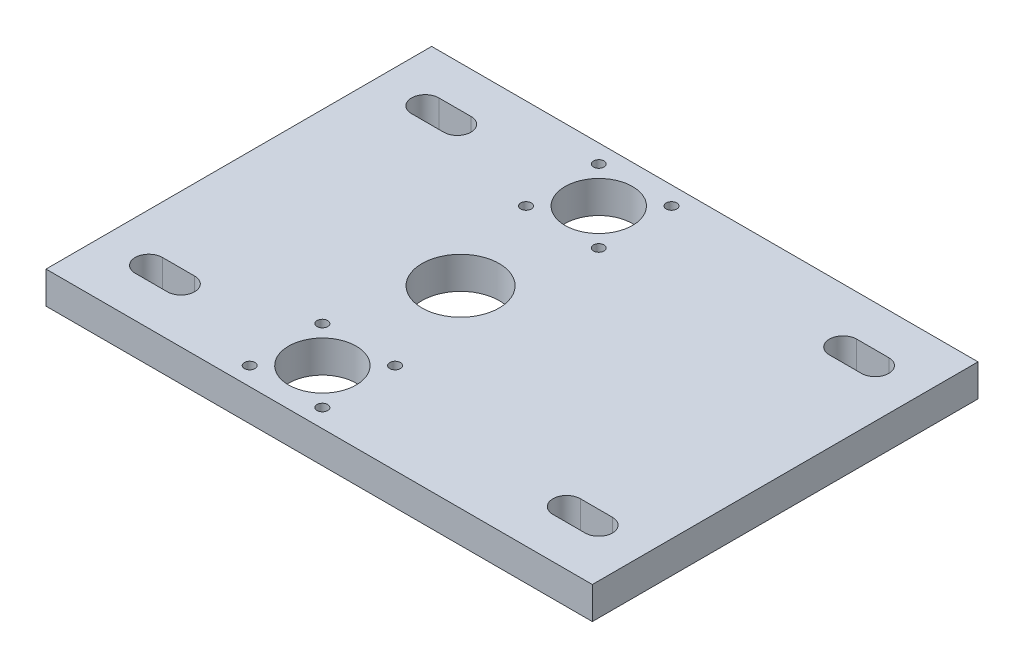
ISO-10303-21;
HEADER;
FILE_DESCRIPTION(('STEP AP214'),'2;1');
FILE_NAME('part.step','',(''),(''),'','','');
FILE_SCHEMA(('AUTOMOTIVE_DESIGN { 1 0 10303 214 1 1 1 1 }'));
ENDSEC;
DATA;
#1=APPLICATION_CONTEXT('core data for automotive mechanical design processes');
#2=APPLICATION_PROTOCOL_DEFINITION('international standard','automotive_design',2000,#1);
#3=PRODUCT_CONTEXT('',#1,'mechanical');
#4=PRODUCT('Part','Part','',(#3));
#5=PRODUCT_RELATED_PRODUCT_CATEGORY('part','',(#4));
#6=PRODUCT_DEFINITION_FORMATION('','',#4);
#7=PRODUCT_DEFINITION_CONTEXT('part definition',#1,'design');
#8=PRODUCT_DEFINITION('design','',#6,#7);
#9=PRODUCT_DEFINITION_SHAPE('','',#8);
#10=(LENGTH_UNIT() NAMED_UNIT(*) SI_UNIT(.MILLI.,.METRE.));
#11=(NAMED_UNIT(*) PLANE_ANGLE_UNIT() SI_UNIT($,.RADIAN.));
#12=(NAMED_UNIT(*) SI_UNIT($,.STERADIAN.) SOLID_ANGLE_UNIT());
#13=UNCERTAINTY_MEASURE_WITH_UNIT(LENGTH_MEASURE(1.E-05),#10,'distance_accuracy_value','');
#14=(GEOMETRIC_REPRESENTATION_CONTEXT(3) GLOBAL_UNCERTAINTY_ASSIGNED_CONTEXT((#13)) GLOBAL_UNIT_ASSIGNED_CONTEXT((#10,
#11,#12)) REPRESENTATION_CONTEXT('',''));
#15=CARTESIAN_POINT('',(0.,0.,0.));
#16=DIRECTION('',(0.,0.,1.));
#17=DIRECTION('',(1.,0.,0.));
#18=AXIS2_PLACEMENT_3D('',#15,#16,#17);
#19=CARTESIAN_POINT('',(0.,10.,0.));
#20=DIRECTION('',(0.,1.,0.));
#21=DIRECTION('',(0.,0.,1.));
#22=AXIS2_PLACEMENT_3D('',#19,#20,#21);
#23=PLANE('',#22);
#24=DIRECTION('',(0.,0.,-1.));
#25=VECTOR('',#24,1.);
#26=CARTESIAN_POINT('',(-85.,10.,-60.));
#27=LINE('',#26,#25);
#28=CARTESIAN_POINT('',(-85.,10.,-60.));
#29=VERTEX_POINT('',#28);
#30=CARTESIAN_POINT('',(-85.,10.,60.));
#31=VERTEX_POINT('',#30);
#32=EDGE_CURVE('E739',#29,#31,#27,.F.);
#33=ORIENTED_EDGE('',*,*,#32,.T.);
#34=DIRECTION('',(-1.,0.,0.));
#35=VECTOR('',#34,1.);
#36=CARTESIAN_POINT('',(-85.,10.,60.));
#37=LINE('',#36,#35);
#38=CARTESIAN_POINT('',(85.,10.,60.));
#39=VERTEX_POINT('',#38);
#40=EDGE_CURVE('E734',#31,#39,#37,.F.);
#41=ORIENTED_EDGE('',*,*,#40,.T.);
#42=DIRECTION('',(0.,0.,1.));
#43=VECTOR('',#42,1.);
#44=CARTESIAN_POINT('',(85.,10.,-60.));
#45=LINE('',#44,#43);
#46=CARTESIAN_POINT('',(85.,10.,-60.));
#47=VERTEX_POINT('',#46);
#48=EDGE_CURVE('E730',#39,#47,#45,.F.);
#49=ORIENTED_EDGE('',*,*,#48,.T.);
#50=DIRECTION('',(1.,0.,0.));
#51=VECTOR('',#50,1.);
#52=CARTESIAN_POINT('',(-85.,10.,-60.));
#53=LINE('',#52,#51);
#54=EDGE_CURVE('E256',#47,#29,#53,.F.);
#55=ORIENTED_EDGE('',*,*,#54,.T.);
#56=EDGE_LOOP('',(#33,#41,#49,#55));
#57=FACE_BOUND('',#56,.T.);
#58=CARTESIAN_POINT('',(-16.,10.,-43.));
#59=DIRECTION('',(0.,1.,0.));
#60=DIRECTION('',(0.,0.,1.));
#61=AXIS2_PLACEMENT_3D('',#58,#59,#60);
#62=CIRCLE('',#61,10.5);
#63=CARTESIAN_POINT('',(-16.,10.,-32.5));
#64=VERTEX_POINT('',#63);
#65=EDGE_CURVE('E253',#64,#64,#62,.F.);
#66=ORIENTED_EDGE('',*,*,#65,.T.);
#67=EDGE_LOOP('',(#66));
#68=FACE_BOUND('',#67,.T.);
#69=CARTESIAN_POINT('',(-16.,10.,0.));
#70=DIRECTION('',(0.,1.,0.));
#71=DIRECTION('',(0.,0.,1.));
#72=AXIS2_PLACEMENT_3D('',#69,#70,#71);
#73=CIRCLE('',#72,12.);
#74=CARTESIAN_POINT('',(-16.,10.,12.));
#75=VERTEX_POINT('',#74);
#76=EDGE_CURVE('E257',#75,#75,#73,.F.);
#77=ORIENTED_EDGE('',*,*,#76,.T.);
#78=EDGE_LOOP('',(#77));
#79=FACE_BOUND('',#78,.T.);
#80=CARTESIAN_POINT('',(-16.,10.,43.));
#81=DIRECTION('',(0.,1.,0.));
#82=DIRECTION('',(0.,0.,1.));
#83=AXIS2_PLACEMENT_3D('',#80,#81,#82);
#84=CIRCLE('',#83,10.5);
#85=CARTESIAN_POINT('',(-16.,10.,53.5));
#86=VERTEX_POINT('',#85);
#87=EDGE_CURVE('E260',#86,#86,#84,.F.);
#88=ORIENTED_EDGE('',*,*,#87,.T.);
#89=EDGE_LOOP('',(#88));
#90=FACE_BOUND('',#89,.T.);
#91=CARTESIAN_POINT('',(-60.,10.,43.));
#92=DIRECTION('',(0.,1.,0.));
#93=DIRECTION('',(0.,0.,1.));
#94=AXIS2_PLACEMENT_3D('',#91,#92,#93);
#95=CIRCLE('',#94,4.24999999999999);
#96=CARTESIAN_POINT('',(-60.,10.,38.75));
#97=VERTEX_POINT('',#96);
#98=CARTESIAN_POINT('',(-60.,10.,47.25));
#99=VERTEX_POINT('',#98);
#100=EDGE_CURVE('E268',#97,#99,#95,.F.);
#101=ORIENTED_EDGE('',*,*,#100,.T.);
#102=DIRECTION('',(1.,0.,0.));
#103=VECTOR('',#102,1.);
#104=CARTESIAN_POINT('',(-70.,10.,47.25));
#105=LINE('',#104,#103);
#106=CARTESIAN_POINT('',(-70.,10.,47.25));
#107=VERTEX_POINT('',#106);
#108=EDGE_CURVE('E752',#99,#107,#105,.F.);
#109=ORIENTED_EDGE('',*,*,#108,.T.);
#110=CARTESIAN_POINT('',(-70.,10.,43.));
#111=DIRECTION('',(0.,1.,0.));
#112=DIRECTION('',(0.,0.,1.));
#113=AXIS2_PLACEMENT_3D('',#110,#111,#112);
#114=CIRCLE('',#113,4.25);
#115=CARTESIAN_POINT('',(-70.,10.,38.75));
#116=VERTEX_POINT('',#115);
#117=EDGE_CURVE('E264',#107,#116,#114,.F.);
#118=ORIENTED_EDGE('',*,*,#117,.T.);
#119=DIRECTION('',(-1.,0.,0.));
#120=VECTOR('',#119,1.);
#121=CARTESIAN_POINT('',(-70.,10.,38.75));
#122=LINE('',#121,#120);
#123=EDGE_CURVE('E263',#116,#97,#122,.F.);
#124=ORIENTED_EDGE('',*,*,#123,.T.);
#125=EDGE_LOOP('',(#101,#109,#118,#124));
#126=FACE_BOUND('',#125,.T.);
#127=CARTESIAN_POINT('',(60.0000000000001,10.,43.));
#128=DIRECTION('',(0.,1.,0.));
#129=DIRECTION('',(0.,0.,1.));
#130=AXIS2_PLACEMENT_3D('',#127,#128,#129);
#131=CIRCLE('',#130,4.25);
#132=CARTESIAN_POINT('',(60.0000000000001,10.,47.25));
#133=VERTEX_POINT('',#132);
#134=CARTESIAN_POINT('',(60.0000000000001,10.,38.75));
#135=VERTEX_POINT('',#134);
#136=EDGE_CURVE('E276',#133,#135,#131,.F.);
#137=ORIENTED_EDGE('',*,*,#136,.T.);
#138=DIRECTION('',(-1.,0.,0.));
#139=VECTOR('',#138,1.);
#140=CARTESIAN_POINT('',(70.,10.,38.75));
#141=LINE('',#140,#139);
#142=CARTESIAN_POINT('',(70.,10.,38.75));
#143=VERTEX_POINT('',#142);
#144=EDGE_CURVE('E762',#135,#143,#141,.F.);
#145=ORIENTED_EDGE('',*,*,#144,.T.);
#146=CARTESIAN_POINT('',(70.,10.,43.));
#147=DIRECTION('',(0.,1.,0.));
#148=DIRECTION('',(0.,0.,1.));
#149=AXIS2_PLACEMENT_3D('',#146,#147,#148);
#150=CIRCLE('',#149,4.25);
#151=CARTESIAN_POINT('',(70.,10.,47.25));
#152=VERTEX_POINT('',#151);
#153=EDGE_CURVE('E272',#143,#152,#150,.F.);
#154=ORIENTED_EDGE('',*,*,#153,.T.);
#155=DIRECTION('',(1.,0.,0.));
#156=VECTOR('',#155,1.);
#157=CARTESIAN_POINT('',(70.,10.,47.25));
#158=LINE('',#157,#156);
#159=EDGE_CURVE('E271',#152,#133,#158,.F.);
#160=ORIENTED_EDGE('',*,*,#159,.T.);
#161=EDGE_LOOP('',(#137,#145,#154,#160));
#162=FACE_BOUND('',#161,.T.);
#163=CARTESIAN_POINT('',(-60.,10.,-43.));
#164=DIRECTION('',(0.,1.,0.));
#165=DIRECTION('',(0.,0.,1.));
#166=AXIS2_PLACEMENT_3D('',#163,#164,#165);
#167=CIRCLE('',#166,4.24999999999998);
#168=CARTESIAN_POINT('',(-60.,10.,-47.25));
#169=VERTEX_POINT('',#168);
#170=CARTESIAN_POINT('',(-60.,10.,-38.75));
#171=VERTEX_POINT('',#170);
#172=EDGE_CURVE('E176',#169,#171,#167,.F.);
#173=ORIENTED_EDGE('',*,*,#172,.T.);
#174=DIRECTION('',(1.,0.,0.));
#175=VECTOR('',#174,1.);
#176=CARTESIAN_POINT('',(-70.,10.,-38.75));
#177=LINE('',#176,#175);
#178=CARTESIAN_POINT('',(-70.,10.,-38.75));
#179=VERTEX_POINT('',#178);
#180=EDGE_CURVE('E183',#171,#179,#177,.F.);
#181=ORIENTED_EDGE('',*,*,#180,.T.);
#182=CARTESIAN_POINT('',(-70.,10.,-43.));
#183=DIRECTION('',(0.,1.,0.));
#184=DIRECTION('',(0.,0.,1.));
#185=AXIS2_PLACEMENT_3D('',#182,#183,#184);
#186=CIRCLE('',#185,4.25);
#187=CARTESIAN_POINT('',(-70.,10.,-47.25));
#188=VERTEX_POINT('',#187);
#189=EDGE_CURVE('E280',#179,#188,#186,.F.);
#190=ORIENTED_EDGE('',*,*,#189,.T.);
#191=DIRECTION('',(-1.,0.,0.));
#192=VECTOR('',#191,1.);
#193=CARTESIAN_POINT('',(-70.,10.,-47.25));
#194=LINE('',#193,#192);
#195=EDGE_CURVE('E279',#188,#169,#194,.F.);
#196=ORIENTED_EDGE('',*,*,#195,.T.);
#197=EDGE_LOOP('',(#173,#181,#190,#196));
#198=FACE_BOUND('',#197,.T.);
#199=CARTESIAN_POINT('',(70.,10.,-43.));
#200=DIRECTION('',(0.,1.,0.));
#201=DIRECTION('',(0.,0.,1.));
#202=AXIS2_PLACEMENT_3D('',#199,#200,#201);
#203=CIRCLE('',#202,4.25);
#204=CARTESIAN_POINT('',(70.,10.,-47.25));
#205=VERTEX_POINT('',#204);
#206=CARTESIAN_POINT('',(70.,10.,-38.75));
#207=VERTEX_POINT('',#206);
#208=EDGE_CURVE('E152',#205,#207,#203,.F.);
#209=ORIENTED_EDGE('',*,*,#208,.T.);
#210=DIRECTION('',(1.,0.,0.));
#211=VECTOR('',#210,1.);
#212=CARTESIAN_POINT('',(60.0000000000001,10.,-38.75));
#213=LINE('',#212,#211);
#214=CARTESIAN_POINT('',(60.0000000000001,10.,-38.75));
#215=VERTEX_POINT('',#214);
#216=EDGE_CURVE('E185',#207,#215,#213,.F.);
#217=ORIENTED_EDGE('',*,*,#216,.T.);
#218=CARTESIAN_POINT('',(60.0000000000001,10.,-43.));
#219=DIRECTION('',(0.,1.,0.));
#220=DIRECTION('',(0.,0.,1.));
#221=AXIS2_PLACEMENT_3D('',#218,#219,#220);
#222=CIRCLE('',#221,4.25);
#223=CARTESIAN_POINT('',(60.0000000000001,10.,-47.25));
#224=VERTEX_POINT('',#223);
#225=EDGE_CURVE('E172',#215,#224,#222,.F.);
#226=ORIENTED_EDGE('',*,*,#225,.T.);
#227=DIRECTION('',(-1.,0.,0.));
#228=VECTOR('',#227,1.);
#229=CARTESIAN_POINT('',(60.0000000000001,10.,-47.25));
#230=LINE('',#229,#228);
#231=EDGE_CURVE('E167',#224,#205,#230,.F.);
#232=ORIENTED_EDGE('',*,*,#231,.T.);
#233=EDGE_LOOP('',(#209,#217,#226,#232));
#234=FACE_BOUND('',#233,.T.);
#235=CARTESIAN_POINT('',(-27.3137084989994,10.,54.3137084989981));
#236=DIRECTION('',(0.,1.,0.));
#237=DIRECTION('',(0.,0.,1.));
#238=AXIS2_PLACEMENT_3D('',#235,#236,#237);
#239=CIRCLE('',#238,1.64999999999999);
#240=CARTESIAN_POINT('',(-27.3137084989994,10.,55.9637084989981));
#241=VERTEX_POINT('',#240);
#242=EDGE_CURVE('E162',#241,#241,#239,.F.);
#243=ORIENTED_EDGE('',*,*,#242,.T.);
#244=EDGE_LOOP('',(#243));
#245=FACE_BOUND('',#244,.T.);
#246=CARTESIAN_POINT('',(-4.68629150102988,10.,54.3137084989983));
#247=DIRECTION('',(0.,1.,0.));
#248=DIRECTION('',(0.,0.,1.));
#249=AXIS2_PLACEMENT_3D('',#246,#247,#248);
#250=CIRCLE('',#249,1.64999999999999);
#251=CARTESIAN_POINT('',(-4.68629150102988,10.,55.9637084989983));
#252=VERTEX_POINT('',#251);
#253=EDGE_CURVE('E287',#252,#252,#250,.F.);
#254=ORIENTED_EDGE('',*,*,#253,.T.);
#255=EDGE_LOOP('',(#254));
#256=FACE_BOUND('',#255,.T.);
#257=CARTESIAN_POINT('',(-4.68629150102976,10.,31.6862915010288));
#258=DIRECTION('',(0.,1.,0.));
#259=DIRECTION('',(0.,0.,1.));
#260=AXIS2_PLACEMENT_3D('',#257,#258,#259);
#261=CIRCLE('',#260,1.64999999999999);
#262=CARTESIAN_POINT('',(-4.68629150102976,10.,33.3362915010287));
#263=VERTEX_POINT('',#262);
#264=EDGE_CURVE('E290',#263,#263,#261,.F.);
#265=ORIENTED_EDGE('',*,*,#264,.T.);
#266=EDGE_LOOP('',(#265));
#267=FACE_BOUND('',#266,.T.);
#268=CARTESIAN_POINT('',(-27.3137084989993,10.,31.6862915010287));
#269=DIRECTION('',(0.,1.,0.));
#270=DIRECTION('',(0.,0.,1.));
#271=AXIS2_PLACEMENT_3D('',#268,#269,#270);
#272=CIRCLE('',#271,1.64999999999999);
#273=CARTESIAN_POINT('',(-27.3137084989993,10.,33.3362915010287));
#274=VERTEX_POINT('',#273);
#275=EDGE_CURVE('E293',#274,#274,#272,.F.);
#276=ORIENTED_EDGE('',*,*,#275,.T.);
#277=EDGE_LOOP('',(#276));
#278=FACE_BOUND('',#277,.T.);
#279=CARTESIAN_POINT('',(-27.3137084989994,10.,-31.6862915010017));
#280=DIRECTION('',(0.,1.,0.));
#281=DIRECTION('',(0.,0.,1.));
#282=AXIS2_PLACEMENT_3D('',#279,#280,#281);
#283=CIRCLE('',#282,1.64999999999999);
#284=CARTESIAN_POINT('',(-27.3137084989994,10.,-30.0362915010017));
#285=VERTEX_POINT('',#284);
#286=EDGE_CURVE('E296',#285,#285,#283,.F.);
#287=ORIENTED_EDGE('',*,*,#286,.T.);
#288=EDGE_LOOP('',(#287));
#289=FACE_BOUND('',#288,.T.);
#290=CARTESIAN_POINT('',(-4.68629150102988,10.,-31.6862915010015));
#291=DIRECTION('',(0.,1.,0.));
#292=DIRECTION('',(0.,0.,1.));
#293=AXIS2_PLACEMENT_3D('',#290,#291,#292);
#294=CIRCLE('',#293,1.64999999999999);
#295=CARTESIAN_POINT('',(-4.68629150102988,10.,-30.0362915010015));
#296=VERTEX_POINT('',#295);
#297=EDGE_CURVE('E299',#296,#296,#294,.F.);
#298=ORIENTED_EDGE('',*,*,#297,.T.);
#299=EDGE_LOOP('',(#298));
#300=FACE_BOUND('',#299,.T.);
#301=CARTESIAN_POINT('',(-4.68629150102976,10.,-54.3137084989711));
#302=DIRECTION('',(0.,1.,0.));
#303=DIRECTION('',(0.,0.,1.));
#304=AXIS2_PLACEMENT_3D('',#301,#302,#303);
#305=CIRCLE('',#304,1.64999999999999);
#306=CARTESIAN_POINT('',(-4.68629150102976,10.,-52.6637084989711));
#307=VERTEX_POINT('',#306);
#308=EDGE_CURVE('E301',#307,#307,#305,.F.);
#309=ORIENTED_EDGE('',*,*,#308,.T.);
#310=EDGE_LOOP('',(#309));
#311=FACE_BOUND('',#310,.T.);
#312=CARTESIAN_POINT('',(-27.3137084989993,10.,-54.3137084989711));
#313=DIRECTION('',(0.,1.,0.));
#314=DIRECTION('',(0.,0.,1.));
#315=AXIS2_PLACEMENT_3D('',#312,#313,#314);
#316=CIRCLE('',#315,1.64999999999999);
#317=CARTESIAN_POINT('',(-27.3137084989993,10.,-52.6637084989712));
#318=VERTEX_POINT('',#317);
#319=EDGE_CURVE('E20',#318,#318,#316,.F.);
#320=ORIENTED_EDGE('',*,*,#319,.T.);
#321=EDGE_LOOP('',(#320));
#322=FACE_BOUND('',#321,.T.);
#323=ADVANCED_FACE('F17',(#57,#68,#79,#90,#126,#162,#198,#234,#245,#256,#267,#278,#289,#300,
#311,#322),#23,.T.);
#324=CARTESIAN_POINT('',(-27.3137084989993,10.,-54.3137084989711));
#325=DIRECTION('',(0.,1.,0.));
#326=DIRECTION('',(0.,0.,1.));
#327=AXIS2_PLACEMENT_3D('',#324,#325,#326);
#328=CYLINDRICAL_SURFACE('',#327,1.64999999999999);
#329=CARTESIAN_POINT('',(-27.3137084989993,0.,-54.3137084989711));
#330=DIRECTION('',(0.,1.,0.));
#331=DIRECTION('',(0.,0.,1.));
#332=AXIS2_PLACEMENT_3D('',#329,#330,#331);
#333=CIRCLE('',#332,1.64999999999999);
#334=CARTESIAN_POINT('',(-27.3137084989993,0.,-52.6637084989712));
#335=VERTEX_POINT('',#334);
#336=EDGE_CURVE('E249',#335,#335,#333,.F.);
#337=ORIENTED_EDGE('',*,*,#336,.T.);
#338=EDGE_LOOP('',(#337));
#339=FACE_BOUND('',#338,.T.);
#340=ORIENTED_EDGE('',*,*,#319,.F.);
#341=EDGE_LOOP('',(#340));
#342=FACE_BOUND('',#341,.T.);
#343=ADVANCED_FACE('F309',(#339,#342),#328,.F.);
#344=CARTESIAN_POINT('',(-4.68629150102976,10.,-54.3137084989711));
#345=DIRECTION('',(0.,1.,0.));
#346=DIRECTION('',(0.,0.,1.));
#347=AXIS2_PLACEMENT_3D('',#344,#345,#346);
#348=CYLINDRICAL_SURFACE('',#347,1.64999999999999);
#349=CARTESIAN_POINT('',(-4.68629150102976,0.,-54.3137084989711));
#350=DIRECTION('',(0.,1.,0.));
#351=DIRECTION('',(0.,0.,1.));
#352=AXIS2_PLACEMENT_3D('',#349,#350,#351);
#353=CIRCLE('',#352,1.64999999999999);
#354=CARTESIAN_POINT('',(-4.68629150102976,0.,-52.6637084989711));
#355=VERTEX_POINT('',#354);
#356=EDGE_CURVE('E246',#355,#355,#353,.F.);
#357=ORIENTED_EDGE('',*,*,#356,.T.);
#358=EDGE_LOOP('',(#357));
#359=FACE_BOUND('',#358,.T.);
#360=ORIENTED_EDGE('',*,*,#308,.F.);
#361=EDGE_LOOP('',(#360));
#362=FACE_BOUND('',#361,.T.);
#363=ADVANCED_FACE('F311',(#359,#362),#348,.F.);
#364=CARTESIAN_POINT('',(-4.68629150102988,10.,-31.6862915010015));
#365=DIRECTION('',(0.,1.,0.));
#366=DIRECTION('',(0.,0.,1.));
#367=AXIS2_PLACEMENT_3D('',#364,#365,#366);
#368=CYLINDRICAL_SURFACE('',#367,1.64999999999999);
#369=CARTESIAN_POINT('',(-4.68629150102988,0.,-31.6862915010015));
#370=DIRECTION('',(0.,1.,0.));
#371=DIRECTION('',(0.,0.,1.));
#372=AXIS2_PLACEMENT_3D('',#369,#370,#371);
#373=CIRCLE('',#372,1.64999999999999);
#374=CARTESIAN_POINT('',(-4.68629150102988,0.,-30.0362915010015));
#375=VERTEX_POINT('',#374);
#376=EDGE_CURVE('E243',#375,#375,#373,.F.);
#377=ORIENTED_EDGE('',*,*,#376,.T.);
#378=EDGE_LOOP('',(#377));
#379=FACE_BOUND('',#378,.T.);
#380=ORIENTED_EDGE('',*,*,#297,.F.);
#381=EDGE_LOOP('',(#380));
#382=FACE_BOUND('',#381,.T.);
#383=ADVANCED_FACE('F318',(#379,#382),#368,.F.);
#384=CARTESIAN_POINT('',(-27.3137084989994,10.,-31.6862915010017));
#385=DIRECTION('',(0.,1.,0.));
#386=DIRECTION('',(0.,0.,1.));
#387=AXIS2_PLACEMENT_3D('',#384,#385,#386);
#388=CYLINDRICAL_SURFACE('',#387,1.64999999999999);
#389=CARTESIAN_POINT('',(-27.3137084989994,0.,-31.6862915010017));
#390=DIRECTION('',(0.,1.,0.));
#391=DIRECTION('',(0.,0.,1.));
#392=AXIS2_PLACEMENT_3D('',#389,#390,#391);
#393=CIRCLE('',#392,1.64999999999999);
#394=CARTESIAN_POINT('',(-27.3137084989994,0.,-30.0362915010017));
#395=VERTEX_POINT('',#394);
#396=EDGE_CURVE('E240',#395,#395,#393,.F.);
#397=ORIENTED_EDGE('',*,*,#396,.T.);
#398=EDGE_LOOP('',(#397));
#399=FACE_BOUND('',#398,.T.);
#400=ORIENTED_EDGE('',*,*,#286,.F.);
#401=EDGE_LOOP('',(#400));
#402=FACE_BOUND('',#401,.T.);
#403=ADVANCED_FACE('F433',(#399,#402),#388,.F.);
#404=CARTESIAN_POINT('',(-27.3137084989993,10.,31.6862915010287));
#405=DIRECTION('',(0.,1.,0.));
#406=DIRECTION('',(0.,0.,1.));
#407=AXIS2_PLACEMENT_3D('',#404,#405,#406);
#408=CYLINDRICAL_SURFACE('',#407,1.64999999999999);
#409=CARTESIAN_POINT('',(-27.3137084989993,0.,31.6862915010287));
#410=DIRECTION('',(0.,1.,0.));
#411=DIRECTION('',(0.,0.,1.));
#412=AXIS2_PLACEMENT_3D('',#409,#410,#411);
#413=CIRCLE('',#412,1.64999999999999);
#414=CARTESIAN_POINT('',(-27.3137084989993,0.,33.3362915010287));
#415=VERTEX_POINT('',#414);
#416=EDGE_CURVE('E237',#415,#415,#413,.F.);
#417=ORIENTED_EDGE('',*,*,#416,.T.);
#418=EDGE_LOOP('',(#417));
#419=FACE_BOUND('',#418,.T.);
#420=ORIENTED_EDGE('',*,*,#275,.F.);
#421=EDGE_LOOP('',(#420));
#422=FACE_BOUND('',#421,.T.);
#423=ADVANCED_FACE('F429',(#419,#422),#408,.F.);
#424=CARTESIAN_POINT('',(-4.68629150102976,10.,31.6862915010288));
#425=DIRECTION('',(0.,1.,0.));
#426=DIRECTION('',(0.,0.,1.));
#427=AXIS2_PLACEMENT_3D('',#424,#425,#426);
#428=CYLINDRICAL_SURFACE('',#427,1.64999999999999);
#429=CARTESIAN_POINT('',(-4.68629150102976,0.,31.6862915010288));
#430=DIRECTION('',(0.,1.,0.));
#431=DIRECTION('',(0.,0.,1.));
#432=AXIS2_PLACEMENT_3D('',#429,#430,#431);
#433=CIRCLE('',#432,1.64999999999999);
#434=CARTESIAN_POINT('',(-4.68629150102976,0.,33.3362915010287));
#435=VERTEX_POINT('',#434);
#436=EDGE_CURVE('E234',#435,#435,#433,.F.);
#437=ORIENTED_EDGE('',*,*,#436,.T.);
#438=EDGE_LOOP('',(#437));
#439=FACE_BOUND('',#438,.T.);
#440=ORIENTED_EDGE('',*,*,#264,.F.);
#441=EDGE_LOOP('',(#440));
#442=FACE_BOUND('',#441,.T.);
#443=ADVANCED_FACE('F425',(#439,#442),#428,.F.);
#444=CARTESIAN_POINT('',(-4.68629150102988,10.,54.3137084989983));
#445=DIRECTION('',(0.,1.,0.));
#446=DIRECTION('',(0.,0.,1.));
#447=AXIS2_PLACEMENT_3D('',#444,#445,#446);
#448=CYLINDRICAL_SURFACE('',#447,1.64999999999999);
#449=CARTESIAN_POINT('',(-4.68629150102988,0.,54.3137084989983));
#450=DIRECTION('',(0.,1.,0.));
#451=DIRECTION('',(0.,0.,1.));
#452=AXIS2_PLACEMENT_3D('',#449,#450,#451);
#453=CIRCLE('',#452,1.64999999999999);
#454=CARTESIAN_POINT('',(-4.68629150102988,0.,55.9637084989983));
#455=VERTEX_POINT('',#454);
#456=EDGE_CURVE('E231',#455,#455,#453,.F.);
#457=ORIENTED_EDGE('',*,*,#456,.T.);
#458=EDGE_LOOP('',(#457));
#459=FACE_BOUND('',#458,.T.);
#460=ORIENTED_EDGE('',*,*,#253,.F.);
#461=EDGE_LOOP('',(#460));
#462=FACE_BOUND('',#461,.T.);
#463=ADVANCED_FACE('F421',(#459,#462),#448,.F.);
#464=CARTESIAN_POINT('',(-27.3137084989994,10.,54.3137084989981));
#465=DIRECTION('',(0.,1.,0.));
#466=DIRECTION('',(0.,0.,1.));
#467=AXIS2_PLACEMENT_3D('',#464,#465,#466);
#468=CYLINDRICAL_SURFACE('',#467,1.64999999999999);
#469=CARTESIAN_POINT('',(-27.3137084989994,0.,54.3137084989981));
#470=DIRECTION('',(0.,1.,0.));
#471=DIRECTION('',(0.,0.,1.));
#472=AXIS2_PLACEMENT_3D('',#469,#470,#471);
#473=CIRCLE('',#472,1.64999999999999);
#474=CARTESIAN_POINT('',(-27.3137084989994,0.,55.9637084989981));
#475=VERTEX_POINT('',#474);
#476=EDGE_CURVE('E228',#475,#475,#473,.F.);
#477=ORIENTED_EDGE('',*,*,#476,.T.);
#478=EDGE_LOOP('',(#477));
#479=FACE_BOUND('',#478,.T.);
#480=ORIENTED_EDGE('',*,*,#242,.F.);
#481=EDGE_LOOP('',(#480));
#482=FACE_BOUND('',#481,.T.);
#483=ADVANCED_FACE('F418',(#479,#482),#468,.F.);
#484=CARTESIAN_POINT('',(70.,0.,-43.));
#485=DIRECTION('',(0.,1.,0.));
#486=DIRECTION('',(0.,0.,1.));
#487=AXIS2_PLACEMENT_3D('',#484,#485,#486);
#488=CYLINDRICAL_SURFACE('',#487,4.25);
#489=DIRECTION('',(0.,1.,0.));
#490=VECTOR('',#489,1.);
#491=CARTESIAN_POINT('',(70.,0.,-47.25));
#492=LINE('',#491,#490);
#493=CARTESIAN_POINT('',(70.,0.,-47.25));
#494=VERTEX_POINT('',#493);
#495=EDGE_CURVE('E156',#205,#494,#492,.F.);
#496=ORIENTED_EDGE('',*,*,#495,.T.);
#497=CARTESIAN_POINT('',(70.,0.,-43.));
#498=DIRECTION('',(0.,1.,0.));
#499=DIRECTION('',(0.,0.,1.));
#500=AXIS2_PLACEMENT_3D('',#497,#498,#499);
#501=CIRCLE('',#500,4.25);
#502=CARTESIAN_POINT('',(70.,0.,-38.75));
#503=VERTEX_POINT('',#502);
#504=EDGE_CURVE('E226',#494,#503,#501,.F.);
#505=ORIENTED_EDGE('',*,*,#504,.T.);
#506=DIRECTION('',(0.,1.,0.));
#507=VECTOR('',#506,1.);
#508=CARTESIAN_POINT('',(70.,0.,-38.75));
#509=LINE('',#508,#507);
#510=EDGE_CURVE('E158',#503,#207,#509,.T.);
#511=ORIENTED_EDGE('',*,*,#510,.T.);
#512=ORIENTED_EDGE('',*,*,#208,.F.);
#513=EDGE_LOOP('',(#496,#505,#511,#512));
#514=FACE_BOUND('',#513,.T.);
#515=ADVANCED_FACE('F154',(#514),#488,.F.);
#516=CARTESIAN_POINT('',(60.0000000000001,0.,-38.75));
#517=DIRECTION('',(0.,0.,1.));
#518=DIRECTION('',(1.,0.,0.));
#519=AXIS2_PLACEMENT_3D('',#516,#517,#518);
#520=PLANE('',#519);
#521=ORIENTED_EDGE('',*,*,#510,.F.);
#522=DIRECTION('',(1.,0.,0.));
#523=VECTOR('',#522,1.);
#524=CARTESIAN_POINT('',(0.,0.,-38.75));
#525=LINE('',#524,#523);
#526=CARTESIAN_POINT('',(60.0000000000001,0.,-38.75));
#527=VERTEX_POINT('',#526);
#528=EDGE_CURVE('E225',#503,#527,#525,.F.);
#529=ORIENTED_EDGE('',*,*,#528,.T.);
#530=DIRECTION('',(0.,1.,0.));
#531=VECTOR('',#530,1.);
#532=CARTESIAN_POINT('',(60.0000000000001,0.,-38.75));
#533=LINE('',#532,#531);
#534=EDGE_CURVE('E187',#527,#215,#533,.T.);
#535=ORIENTED_EDGE('',*,*,#534,.T.);
#536=ORIENTED_EDGE('',*,*,#216,.F.);
#537=EDGE_LOOP('',(#521,#529,#535,#536));
#538=FACE_BOUND('',#537,.T.);
#539=ADVANCED_FACE('F411',(#538),#520,.F.);
#540=CARTESIAN_POINT('',(60.0000000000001,0.,-43.));
#541=DIRECTION('',(0.,1.,0.));
#542=DIRECTION('',(0.,0.,1.));
#543=AXIS2_PLACEMENT_3D('',#540,#541,#542);
#544=CYLINDRICAL_SURFACE('',#543,4.25);
#545=ORIENTED_EDGE('',*,*,#534,.F.);
#546=CARTESIAN_POINT('',(60.0000000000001,0.,-43.));
#547=DIRECTION('',(0.,1.,0.));
#548=DIRECTION('',(0.,0.,1.));
#549=AXIS2_PLACEMENT_3D('',#546,#547,#548);
#550=CIRCLE('',#549,4.25);
#551=CARTESIAN_POINT('',(60.0000000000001,0.,-47.25));
#552=VERTEX_POINT('',#551);
#553=EDGE_CURVE('E222',#527,#552,#550,.F.);
#554=ORIENTED_EDGE('',*,*,#553,.T.);
#555=DIRECTION('',(0.,1.,0.));
#556=VECTOR('',#555,1.);
#557=CARTESIAN_POINT('',(60.0000000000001,0.,-47.25));
#558=LINE('',#557,#556);
#559=EDGE_CURVE('E171',#552,#224,#558,.T.);
#560=ORIENTED_EDGE('',*,*,#559,.T.);
#561=ORIENTED_EDGE('',*,*,#225,.F.);
#562=EDGE_LOOP('',(#545,#554,#560,#561));
#563=FACE_BOUND('',#562,.T.);
#564=ADVANCED_FACE('F408',(#563),#544,.F.);
#565=CARTESIAN_POINT('',(60.0000000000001,0.,-47.25));
#566=DIRECTION('',(0.,0.,-1.));
#567=DIRECTION('',(-1.,0.,0.));
#568=AXIS2_PLACEMENT_3D('',#565,#566,#567);
#569=PLANE('',#568);
#570=ORIENTED_EDGE('',*,*,#559,.F.);
#571=DIRECTION('',(1.,0.,0.));
#572=VECTOR('',#571,1.);
#573=CARTESIAN_POINT('',(0.,0.,-47.25));
#574=LINE('',#573,#572);
#575=EDGE_CURVE('E170',#552,#494,#574,.T.);
#576=ORIENTED_EDGE('',*,*,#575,.T.);
#577=ORIENTED_EDGE('',*,*,#495,.F.);
#578=ORIENTED_EDGE('',*,*,#231,.F.);
#579=EDGE_LOOP('',(#570,#576,#577,#578));
#580=FACE_BOUND('',#579,.T.);
#581=ADVANCED_FACE('F166',(#580),#569,.F.);
#582=CARTESIAN_POINT('',(-60.,0.,-43.));
#583=DIRECTION('',(0.,1.,0.));
#584=DIRECTION('',(0.,0.,1.));
#585=AXIS2_PLACEMENT_3D('',#582,#583,#584);
#586=CYLINDRICAL_SURFACE('',#585,4.24999999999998);
#587=DIRECTION('',(0.,1.,0.));
#588=VECTOR('',#587,1.);
#589=CARTESIAN_POINT('',(-60.,0.,-47.25));
#590=LINE('',#589,#588);
#591=CARTESIAN_POINT('',(-60.,0.,-47.25));
#592=VERTEX_POINT('',#591);
#593=EDGE_CURVE('E281',#169,#592,#590,.F.);
#594=ORIENTED_EDGE('',*,*,#593,.T.);
#595=CARTESIAN_POINT('',(-60.,0.,-43.));
#596=DIRECTION('',(0.,1.,0.));
#597=DIRECTION('',(0.,0.,1.));
#598=AXIS2_PLACEMENT_3D('',#595,#596,#597);
#599=CIRCLE('',#598,4.24999999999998);
#600=CARTESIAN_POINT('',(-60.,0.,-38.75));
#601=VERTEX_POINT('',#600);
#602=EDGE_CURVE('E219',#592,#601,#599,.F.);
#603=ORIENTED_EDGE('',*,*,#602,.T.);
#604=DIRECTION('',(0.,1.,0.));
#605=VECTOR('',#604,1.);
#606=CARTESIAN_POINT('',(-60.,0.,-38.75));
#607=LINE('',#606,#605);
#608=EDGE_CURVE('E178',#601,#171,#607,.T.);
#609=ORIENTED_EDGE('',*,*,#608,.T.);
#610=ORIENTED_EDGE('',*,*,#172,.F.);
#611=EDGE_LOOP('',(#594,#603,#609,#610));
#612=FACE_BOUND('',#611,.T.);
#613=ADVANCED_FACE('F401',(#612),#586,.F.);
#614=CARTESIAN_POINT('',(-70.,0.,-38.75));
#615=DIRECTION('',(0.,0.,1.));
#616=DIRECTION('',(1.,0.,0.));
#617=AXIS2_PLACEMENT_3D('',#614,#615,#616);
#618=PLANE('',#617);
#619=ORIENTED_EDGE('',*,*,#608,.F.);
#620=DIRECTION('',(1.,0.,0.));
#621=VECTOR('',#620,1.);
#622=CARTESIAN_POINT('',(0.,0.,-38.75));
#623=LINE('',#622,#621);
#624=CARTESIAN_POINT('',(-70.,0.,-38.75));
#625=VERTEX_POINT('',#624);
#626=EDGE_CURVE('E218',#601,#625,#623,.F.);
#627=ORIENTED_EDGE('',*,*,#626,.T.);
#628=DIRECTION('',(0.,1.,0.));
#629=VECTOR('',#628,1.);
#630=CARTESIAN_POINT('',(-70.,0.,-38.75));
#631=LINE('',#630,#629);
#632=EDGE_CURVE('E282',#625,#179,#631,.T.);
#633=ORIENTED_EDGE('',*,*,#632,.T.);
#634=ORIENTED_EDGE('',*,*,#180,.F.);
#635=EDGE_LOOP('',(#619,#627,#633,#634));
#636=FACE_BOUND('',#635,.T.);
#637=ADVANCED_FACE('F397',(#636),#618,.F.);
#638=CARTESIAN_POINT('',(-70.,0.,-43.));
#639=DIRECTION('',(0.,1.,0.));
#640=DIRECTION('',(0.,0.,1.));
#641=AXIS2_PLACEMENT_3D('',#638,#639,#640);
#642=CYLINDRICAL_SURFACE('',#641,4.25);
#643=ORIENTED_EDGE('',*,*,#632,.F.);
#644=CARTESIAN_POINT('',(-70.,0.,-43.));
#645=DIRECTION('',(0.,1.,0.));
#646=DIRECTION('',(0.,0.,1.));
#647=AXIS2_PLACEMENT_3D('',#644,#645,#646);
#648=CIRCLE('',#647,4.25);
#649=CARTESIAN_POINT('',(-70.,0.,-47.25));
#650=VERTEX_POINT('',#649);
#651=EDGE_CURVE('E215',#625,#650,#648,.F.);
#652=ORIENTED_EDGE('',*,*,#651,.T.);
#653=DIRECTION('',(0.,1.,0.));
#654=VECTOR('',#653,1.);
#655=CARTESIAN_POINT('',(-70.,0.,-47.25));
#656=LINE('',#655,#654);
#657=EDGE_CURVE('E765',#650,#188,#656,.T.);
#658=ORIENTED_EDGE('',*,*,#657,.T.);
#659=ORIENTED_EDGE('',*,*,#189,.F.);
#660=EDGE_LOOP('',(#643,#652,#658,#659));
#661=FACE_BOUND('',#660,.T.);
#662=ADVANCED_FACE('F393',(#661),#642,.F.);
#663=CARTESIAN_POINT('',(-70.,0.,-47.25));
#664=DIRECTION('',(0.,0.,-1.));
#665=DIRECTION('',(-1.,0.,0.));
#666=AXIS2_PLACEMENT_3D('',#663,#664,#665);
#667=PLANE('',#666);
#668=ORIENTED_EDGE('',*,*,#657,.F.);
#669=DIRECTION('',(1.,0.,0.));
#670=VECTOR('',#669,1.);
#671=CARTESIAN_POINT('',(0.,0.,-47.25));
#672=LINE('',#671,#670);
#673=EDGE_CURVE('E214',#650,#592,#672,.T.);
#674=ORIENTED_EDGE('',*,*,#673,.T.);
#675=ORIENTED_EDGE('',*,*,#593,.F.);
#676=ORIENTED_EDGE('',*,*,#195,.F.);
#677=EDGE_LOOP('',(#668,#674,#675,#676));
#678=FACE_BOUND('',#677,.T.);
#679=ADVANCED_FACE('F389',(#678),#667,.F.);
#680=CARTESIAN_POINT('',(60.0000000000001,0.,43.));
#681=DIRECTION('',(0.,1.,0.));
#682=DIRECTION('',(0.,0.,1.));
#683=AXIS2_PLACEMENT_3D('',#680,#681,#682);
#684=CYLINDRICAL_SURFACE('',#683,4.25);
#685=DIRECTION('',(0.,1.,0.));
#686=VECTOR('',#685,1.);
#687=CARTESIAN_POINT('',(60.0000000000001,0.,47.25));
#688=LINE('',#687,#686);
#689=CARTESIAN_POINT('',(60.0000000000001,0.,47.25));
#690=VERTEX_POINT('',#689);
#691=EDGE_CURVE('E274',#133,#690,#688,.F.);
#692=ORIENTED_EDGE('',*,*,#691,.T.);
#693=CARTESIAN_POINT('',(60.0000000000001,0.,43.));
#694=DIRECTION('',(0.,1.,0.));
#695=DIRECTION('',(0.,0.,1.));
#696=AXIS2_PLACEMENT_3D('',#693,#694,#695);
#697=CIRCLE('',#696,4.25);
#698=CARTESIAN_POINT('',(60.0000000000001,0.,38.75));
#699=VERTEX_POINT('',#698);
#700=EDGE_CURVE('E211',#690,#699,#697,.F.);
#701=ORIENTED_EDGE('',*,*,#700,.T.);
#702=DIRECTION('',(0.,1.,0.));
#703=VECTOR('',#702,1.);
#704=CARTESIAN_POINT('',(60.0000000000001,0.,38.75));
#705=LINE('',#704,#703);
#706=EDGE_CURVE('E278',#699,#135,#705,.T.);
#707=ORIENTED_EDGE('',*,*,#706,.T.);
#708=ORIENTED_EDGE('',*,*,#136,.F.);
#709=EDGE_LOOP('',(#692,#701,#707,#708));
#710=FACE_BOUND('',#709,.T.);
#711=ADVANCED_FACE('F385',(#710),#684,.F.);
#712=CARTESIAN_POINT('',(70.,0.,38.75));
#713=DIRECTION('',(0.,0.,-1.));
#714=DIRECTION('',(-1.,0.,0.));
#715=AXIS2_PLACEMENT_3D('',#712,#713,#714);
#716=PLANE('',#715);
#717=ORIENTED_EDGE('',*,*,#706,.F.);
#718=DIRECTION('',(1.,0.,0.));
#719=VECTOR('',#718,1.);
#720=CARTESIAN_POINT('',(0.,0.,38.75));
#721=LINE('',#720,#719);
#722=CARTESIAN_POINT('',(70.,0.,38.75));
#723=VERTEX_POINT('',#722);
#724=EDGE_CURVE('E210',#699,#723,#721,.T.);
#725=ORIENTED_EDGE('',*,*,#724,.T.);
#726=DIRECTION('',(0.,1.,0.));
#727=VECTOR('',#726,1.);
#728=CARTESIAN_POINT('',(70.,0.,38.75));
#729=LINE('',#728,#727);
#730=EDGE_CURVE('E275',#723,#143,#729,.T.);
#731=ORIENTED_EDGE('',*,*,#730,.T.);
#732=ORIENTED_EDGE('',*,*,#144,.F.);
#733=EDGE_LOOP('',(#717,#725,#731,#732));
#734=FACE_BOUND('',#733,.T.);
#735=ADVANCED_FACE('F381',(#734),#716,.F.);
#736=CARTESIAN_POINT('',(70.,0.,43.));
#737=DIRECTION('',(0.,1.,0.));
#738=DIRECTION('',(0.,0.,1.));
#739=AXIS2_PLACEMENT_3D('',#736,#737,#738);
#740=CYLINDRICAL_SURFACE('',#739,4.25);
#741=ORIENTED_EDGE('',*,*,#730,.F.);
#742=CARTESIAN_POINT('',(70.,0.,43.));
#743=DIRECTION('',(0.,1.,0.));
#744=DIRECTION('',(0.,0.,1.));
#745=AXIS2_PLACEMENT_3D('',#742,#743,#744);
#746=CIRCLE('',#745,4.25);
#747=CARTESIAN_POINT('',(70.,0.,47.25));
#748=VERTEX_POINT('',#747);
#749=EDGE_CURVE('E207',#723,#748,#746,.F.);
#750=ORIENTED_EDGE('',*,*,#749,.T.);
#751=DIRECTION('',(0.,1.,0.));
#752=VECTOR('',#751,1.);
#753=CARTESIAN_POINT('',(70.,0.,47.25));
#754=LINE('',#753,#752);
#755=EDGE_CURVE('E755',#748,#152,#754,.T.);
#756=ORIENTED_EDGE('',*,*,#755,.T.);
#757=ORIENTED_EDGE('',*,*,#153,.F.);
#758=EDGE_LOOP('',(#741,#750,#756,#757));
#759=FACE_BOUND('',#758,.T.);
#760=ADVANCED_FACE('F377',(#759),#740,.F.);
#761=CARTESIAN_POINT('',(70.,0.,47.25));
#762=DIRECTION('',(0.,0.,1.));
#763=DIRECTION('',(1.,0.,0.));
#764=AXIS2_PLACEMENT_3D('',#761,#762,#763);
#765=PLANE('',#764);
#766=ORIENTED_EDGE('',*,*,#755,.F.);
#767=DIRECTION('',(1.,0.,0.));
#768=VECTOR('',#767,1.);
#769=CARTESIAN_POINT('',(0.,0.,47.25));
#770=LINE('',#769,#768);
#771=EDGE_CURVE('E206',#748,#690,#770,.F.);
#772=ORIENTED_EDGE('',*,*,#771,.T.);
#773=ORIENTED_EDGE('',*,*,#691,.F.);
#774=ORIENTED_EDGE('',*,*,#159,.F.);
#775=EDGE_LOOP('',(#766,#772,#773,#774));
#776=FACE_BOUND('',#775,.T.);
#777=ADVANCED_FACE('F373',(#776),#765,.F.);
#778=CARTESIAN_POINT('',(-60.,0.,43.));
#779=DIRECTION('',(0.,1.,0.));
#780=DIRECTION('',(0.,0.,1.));
#781=AXIS2_PLACEMENT_3D('',#778,#779,#780);
#782=CYLINDRICAL_SURFACE('',#781,4.24999999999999);
#783=DIRECTION('',(0.,1.,0.));
#784=VECTOR('',#783,1.);
#785=CARTESIAN_POINT('',(-60.,0.,38.75));
#786=LINE('',#785,#784);
#787=CARTESIAN_POINT('',(-60.,0.,38.75));
#788=VERTEX_POINT('',#787);
#789=EDGE_CURVE('E266',#97,#788,#786,.F.);
#790=ORIENTED_EDGE('',*,*,#789,.T.);
#791=CARTESIAN_POINT('',(-60.,0.,43.));
#792=DIRECTION('',(0.,1.,0.));
#793=DIRECTION('',(0.,0.,1.));
#794=AXIS2_PLACEMENT_3D('',#791,#792,#793);
#795=CIRCLE('',#794,4.24999999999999);
#796=CARTESIAN_POINT('',(-60.,0.,47.25));
#797=VERTEX_POINT('',#796);
#798=EDGE_CURVE('E203',#788,#797,#795,.F.);
#799=ORIENTED_EDGE('',*,*,#798,.T.);
#800=DIRECTION('',(0.,1.,0.));
#801=VECTOR('',#800,1.);
#802=CARTESIAN_POINT('',(-60.,0.,47.25));
#803=LINE('',#802,#801);
#804=EDGE_CURVE('E270',#797,#99,#803,.T.);
#805=ORIENTED_EDGE('',*,*,#804,.T.);
#806=ORIENTED_EDGE('',*,*,#100,.F.);
#807=EDGE_LOOP('',(#790,#799,#805,#806));
#808=FACE_BOUND('',#807,.T.);
#809=ADVANCED_FACE('F369',(#808),#782,.F.);
#810=CARTESIAN_POINT('',(-70.,0.,47.25));
#811=DIRECTION('',(0.,0.,1.));
#812=DIRECTION('',(1.,0.,0.));
#813=AXIS2_PLACEMENT_3D('',#810,#811,#812);
#814=PLANE('',#813);
#815=ORIENTED_EDGE('',*,*,#804,.F.);
#816=DIRECTION('',(1.,0.,0.));
#817=VECTOR('',#816,1.);
#818=CARTESIAN_POINT('',(0.,0.,47.25));
#819=LINE('',#818,#817);
#820=CARTESIAN_POINT('',(-70.,0.,47.25));
#821=VERTEX_POINT('',#820);
#822=EDGE_CURVE('E202',#797,#821,#819,.F.);
#823=ORIENTED_EDGE('',*,*,#822,.T.);
#824=DIRECTION('',(0.,1.,0.));
#825=VECTOR('',#824,1.);
#826=CARTESIAN_POINT('',(-70.,0.,47.25));
#827=LINE('',#826,#825);
#828=EDGE_CURVE('E267',#821,#107,#827,.T.);
#829=ORIENTED_EDGE('',*,*,#828,.T.);
#830=ORIENTED_EDGE('',*,*,#108,.F.);
#831=EDGE_LOOP('',(#815,#823,#829,#830));
#832=FACE_BOUND('',#831,.T.);
#833=ADVANCED_FACE('F365',(#832),#814,.F.);
#834=CARTESIAN_POINT('',(-70.,0.,43.));
#835=DIRECTION('',(0.,1.,0.));
#836=DIRECTION('',(0.,0.,1.));
#837=AXIS2_PLACEMENT_3D('',#834,#835,#836);
#838=CYLINDRICAL_SURFACE('',#837,4.25);
#839=ORIENTED_EDGE('',*,*,#828,.F.);
#840=CARTESIAN_POINT('',(-70.,0.,43.));
#841=DIRECTION('',(0.,1.,0.));
#842=DIRECTION('',(0.,0.,1.));
#843=AXIS2_PLACEMENT_3D('',#840,#841,#842);
#844=CIRCLE('',#843,4.25);
#845=CARTESIAN_POINT('',(-70.,0.,38.75));
#846=VERTEX_POINT('',#845);
#847=EDGE_CURVE('E199',#821,#846,#844,.F.);
#848=ORIENTED_EDGE('',*,*,#847,.T.);
#849=DIRECTION('',(0.,1.,0.));
#850=VECTOR('',#849,1.);
#851=CARTESIAN_POINT('',(-70.,0.,38.75));
#852=LINE('',#851,#850);
#853=EDGE_CURVE('E745',#846,#116,#852,.T.);
#854=ORIENTED_EDGE('',*,*,#853,.T.);
#855=ORIENTED_EDGE('',*,*,#117,.F.);
#856=EDGE_LOOP('',(#839,#848,#854,#855));
#857=FACE_BOUND('',#856,.T.);
#858=ADVANCED_FACE('F361',(#857),#838,.F.);
#859=CARTESIAN_POINT('',(-70.,0.,38.75));
#860=DIRECTION('',(0.,0.,-1.));
#861=DIRECTION('',(-1.,0.,0.));
#862=AXIS2_PLACEMENT_3D('',#859,#860,#861);
#863=PLANE('',#862);
#864=ORIENTED_EDGE('',*,*,#853,.F.);
#865=DIRECTION('',(1.,0.,0.));
#866=VECTOR('',#865,1.);
#867=CARTESIAN_POINT('',(0.,0.,38.75));
#868=LINE('',#867,#866);
#869=EDGE_CURVE('E198',#846,#788,#868,.T.);
#870=ORIENTED_EDGE('',*,*,#869,.T.);
#871=ORIENTED_EDGE('',*,*,#789,.F.);
#872=ORIENTED_EDGE('',*,*,#123,.F.);
#873=EDGE_LOOP('',(#864,#870,#871,#872));
#874=FACE_BOUND('',#873,.T.);
#875=ADVANCED_FACE('F357',(#874),#863,.F.);
#876=CARTESIAN_POINT('',(-16.,0.,43.));
#877=DIRECTION('',(0.,1.,0.));
#878=DIRECTION('',(0.,0.,1.));
#879=AXIS2_PLACEMENT_3D('',#876,#877,#878);
#880=CYLINDRICAL_SURFACE('',#879,10.5);
#881=CARTESIAN_POINT('',(-16.,0.,43.));
#882=DIRECTION('',(0.,1.,0.));
#883=DIRECTION('',(0.,0.,1.));
#884=AXIS2_PLACEMENT_3D('',#881,#882,#883);
#885=CIRCLE('',#884,10.5);
#886=CARTESIAN_POINT('',(-16.,0.,53.5));
#887=VERTEX_POINT('',#886);
#888=EDGE_CURVE('E195',#887,#887,#885,.F.);
#889=ORIENTED_EDGE('',*,*,#888,.T.);
#890=EDGE_LOOP('',(#889));
#891=FACE_BOUND('',#890,.T.);
#892=ORIENTED_EDGE('',*,*,#87,.F.);
#893=EDGE_LOOP('',(#892));
#894=FACE_BOUND('',#893,.T.);
#895=ADVANCED_FACE('F353',(#891,#894),#880,.F.);
#896=CARTESIAN_POINT('',(-16.,0.,0.));
#897=DIRECTION('',(0.,1.,0.));
#898=DIRECTION('',(0.,0.,1.));
#899=AXIS2_PLACEMENT_3D('',#896,#897,#898);
#900=CYLINDRICAL_SURFACE('',#899,12.);
#901=CARTESIAN_POINT('',(-16.,0.,0.));
#902=DIRECTION('',(0.,1.,0.));
#903=DIRECTION('',(0.,0.,1.));
#904=AXIS2_PLACEMENT_3D('',#901,#902,#903);
#905=CIRCLE('',#904,12.);
#906=CARTESIAN_POINT('',(-16.,0.,12.));
#907=VERTEX_POINT('',#906);
#908=EDGE_CURVE('E192',#907,#907,#905,.F.);
#909=ORIENTED_EDGE('',*,*,#908,.T.);
#910=EDGE_LOOP('',(#909));
#911=FACE_BOUND('',#910,.T.);
#912=ORIENTED_EDGE('',*,*,#76,.F.);
#913=EDGE_LOOP('',(#912));
#914=FACE_BOUND('',#913,.T.);
#915=ADVANCED_FACE('F349',(#911,#914),#900,.F.);
#916=CARTESIAN_POINT('',(-16.,0.,-43.));
#917=DIRECTION('',(0.,1.,0.));
#918=DIRECTION('',(0.,0.,1.));
#919=AXIS2_PLACEMENT_3D('',#916,#917,#918);
#920=CYLINDRICAL_SURFACE('',#919,10.5);
#921=CARTESIAN_POINT('',(-16.,0.,-43.));
#922=DIRECTION('',(0.,1.,0.));
#923=DIRECTION('',(0.,0.,1.));
#924=AXIS2_PLACEMENT_3D('',#921,#922,#923);
#925=CIRCLE('',#924,10.5);
#926=CARTESIAN_POINT('',(-16.,0.,-32.5));
#927=VERTEX_POINT('',#926);
#928=EDGE_CURVE('E188',#927,#927,#925,.F.);
#929=ORIENTED_EDGE('',*,*,#928,.T.);
#930=EDGE_LOOP('',(#929));
#931=FACE_BOUND('',#930,.T.);
#932=ORIENTED_EDGE('',*,*,#65,.F.);
#933=EDGE_LOOP('',(#932));
#934=FACE_BOUND('',#933,.T.);
#935=ADVANCED_FACE('F345',(#931,#934),#920,.F.);
#936=CARTESIAN_POINT('',(-85.,10.,-60.));
#937=DIRECTION('',(0.,0.,1.));
#938=DIRECTION('',(1.,0.,0.));
#939=AXIS2_PLACEMENT_3D('',#936,#937,#938);
#940=PLANE('',#939);
#941=DIRECTION('',(0.,1.,0.));
#942=VECTOR('',#941,1.);
#943=CARTESIAN_POINT('',(-85.,10.,-60.));
#944=LINE('',#943,#942);
#945=CARTESIAN_POINT('',(-85.,0.,-60.));
#946=VERTEX_POINT('',#945);
#947=EDGE_CURVE('E741',#946,#29,#944,.T.);
#948=ORIENTED_EDGE('',*,*,#947,.T.);
#949=ORIENTED_EDGE('',*,*,#54,.F.);
#950=DIRECTION('',(0.,1.,0.));
#951=VECTOR('',#950,1.);
#952=CARTESIAN_POINT('',(85.,10.,-60.));
#953=LINE('',#952,#951);
#954=CARTESIAN_POINT('',(85.,0.,-60.));
#955=VERTEX_POINT('',#954);
#956=EDGE_CURVE('E252',#47,#955,#953,.F.);
#957=ORIENTED_EDGE('',*,*,#956,.T.);
#958=DIRECTION('',(1.,0.,0.));
#959=VECTOR('',#958,1.);
#960=CARTESIAN_POINT('',(0.,0.,-60.));
#961=LINE('',#960,#959);
#962=EDGE_CURVE('E191',#955,#946,#961,.F.);
#963=ORIENTED_EDGE('',*,*,#962,.T.);
#964=EDGE_LOOP('',(#948,#949,#957,#963));
#965=FACE_BOUND('',#964,.T.);
#966=ADVANCED_FACE('F341',(#965),#940,.F.);
#967=CARTESIAN_POINT('',(-85.,10.,-60.));
#968=DIRECTION('',(1.,0.,0.));
#969=DIRECTION('',(0.,0.,-1.));
#970=AXIS2_PLACEMENT_3D('',#967,#968,#969);
#971=PLANE('',#970);
#972=DIRECTION('',(0.,1.,0.));
#973=VECTOR('',#972,1.);
#974=CARTESIAN_POINT('',(-85.,10.,60.));
#975=LINE('',#974,#973);
#976=CARTESIAN_POINT('',(-85.,0.,60.));
#977=VERTEX_POINT('',#976);
#978=EDGE_CURVE('E736',#977,#31,#975,.T.);
#979=ORIENTED_EDGE('',*,*,#978,.T.);
#980=ORIENTED_EDGE('',*,*,#32,.F.);
#981=ORIENTED_EDGE('',*,*,#947,.F.);
#982=DIRECTION('',(0.,0.,1.));
#983=VECTOR('',#982,1.);
#984=CARTESIAN_POINT('',(-85.,0.,0.));
#985=LINE('',#984,#983);
#986=EDGE_CURVE('E804',#946,#977,#985,.T.);
#987=ORIENTED_EDGE('',*,*,#986,.T.);
#988=EDGE_LOOP('',(#979,#980,#981,#987));
#989=FACE_BOUND('',#988,.T.);
#990=ADVANCED_FACE('F337',(#989),#971,.F.);
#991=CARTESIAN_POINT('',(-85.,10.,60.));
#992=DIRECTION('',(0.,0.,-1.));
#993=DIRECTION('',(-1.,0.,0.));
#994=AXIS2_PLACEMENT_3D('',#991,#992,#993);
#995=PLANE('',#994);
#996=DIRECTION('',(0.,1.,0.));
#997=VECTOR('',#996,1.);
#998=CARTESIAN_POINT('',(85.,10.,60.));
#999=LINE('',#998,#997);
#1000=CARTESIAN_POINT('',(85.,0.,60.));
#1001=VERTEX_POINT('',#1000);
#1002=EDGE_CURVE('E34',#1001,#39,#999,.T.);
#1003=ORIENTED_EDGE('',*,*,#1002,.T.);
#1004=ORIENTED_EDGE('',*,*,#40,.F.);
#1005=ORIENTED_EDGE('',*,*,#978,.F.);
#1006=DIRECTION('',(1.,0.,0.));
#1007=VECTOR('',#1006,1.);
#1008=CARTESIAN_POINT('',(0.,0.,60.));
#1009=LINE('',#1008,#1007);
#1010=EDGE_CURVE('E26',#977,#1001,#1009,.T.);
#1011=ORIENTED_EDGE('',*,*,#1010,.T.);
#1012=EDGE_LOOP('',(#1003,#1004,#1005,#1011));
#1013=FACE_BOUND('',#1012,.T.);
#1014=ADVANCED_FACE('F330',(#1013),#995,.F.);
#1015=CARTESIAN_POINT('',(85.,10.,-60.));
#1016=DIRECTION('',(-1.,0.,0.));
#1017=DIRECTION('',(0.,0.,1.));
#1018=AXIS2_PLACEMENT_3D('',#1015,#1016,#1017);
#1019=PLANE('',#1018);
#1020=ORIENTED_EDGE('',*,*,#956,.F.);
#1021=ORIENTED_EDGE('',*,*,#48,.F.);
#1022=ORIENTED_EDGE('',*,*,#1002,.F.);
#1023=DIRECTION('',(0.,0.,1.));
#1024=VECTOR('',#1023,1.);
#1025=CARTESIAN_POINT('',(85.,0.,0.));
#1026=LINE('',#1025,#1024);
#1027=EDGE_CURVE('E11',#1001,#955,#1026,.F.);
#1028=ORIENTED_EDGE('',*,*,#1027,.T.);
#1029=EDGE_LOOP('',(#1020,#1021,#1022,#1028));
#1030=FACE_BOUND('',#1029,.T.);
#1031=ADVANCED_FACE('F324',(#1030),#1019,.F.);
#1032=CARTESIAN_POINT('',(0.,0.,0.));
#1033=DIRECTION('',(0.,1.,0.));
#1034=DIRECTION('',(0.,0.,1.));
#1035=AXIS2_PLACEMENT_3D('',#1032,#1033,#1034);
#1036=PLANE('',#1035);
#1037=ORIENTED_EDGE('',*,*,#1010,.F.);
#1038=ORIENTED_EDGE('',*,*,#986,.F.);
#1039=ORIENTED_EDGE('',*,*,#962,.F.);
#1040=ORIENTED_EDGE('',*,*,#1027,.F.);
#1041=EDGE_LOOP('',(#1037,#1038,#1039,#1040));
#1042=FACE_BOUND('',#1041,.T.);
#1043=ORIENTED_EDGE('',*,*,#928,.F.);
#1044=EDGE_LOOP('',(#1043));
#1045=FACE_BOUND('',#1044,.T.);
#1046=ORIENTED_EDGE('',*,*,#908,.F.);
#1047=EDGE_LOOP('',(#1046));
#1048=FACE_BOUND('',#1047,.T.);
#1049=ORIENTED_EDGE('',*,*,#888,.F.);
#1050=EDGE_LOOP('',(#1049));
#1051=FACE_BOUND('',#1050,.T.);
#1052=ORIENTED_EDGE('',*,*,#847,.F.);
#1053=ORIENTED_EDGE('',*,*,#822,.F.);
#1054=ORIENTED_EDGE('',*,*,#798,.F.);
#1055=ORIENTED_EDGE('',*,*,#869,.F.);
#1056=EDGE_LOOP('',(#1052,#1053,#1054,#1055));
#1057=FACE_BOUND('',#1056,.T.);
#1058=ORIENTED_EDGE('',*,*,#749,.F.);
#1059=ORIENTED_EDGE('',*,*,#724,.F.);
#1060=ORIENTED_EDGE('',*,*,#700,.F.);
#1061=ORIENTED_EDGE('',*,*,#771,.F.);
#1062=EDGE_LOOP('',(#1058,#1059,#1060,#1061));
#1063=FACE_BOUND('',#1062,.T.);
#1064=ORIENTED_EDGE('',*,*,#651,.F.);
#1065=ORIENTED_EDGE('',*,*,#626,.F.);
#1066=ORIENTED_EDGE('',*,*,#602,.F.);
#1067=ORIENTED_EDGE('',*,*,#673,.F.);
#1068=EDGE_LOOP('',(#1064,#1065,#1066,#1067));
#1069=FACE_BOUND('',#1068,.T.);
#1070=ORIENTED_EDGE('',*,*,#553,.F.);
#1071=ORIENTED_EDGE('',*,*,#528,.F.);
#1072=ORIENTED_EDGE('',*,*,#504,.F.);
#1073=ORIENTED_EDGE('',*,*,#575,.F.);
#1074=EDGE_LOOP('',(#1070,#1071,#1072,#1073));
#1075=FACE_BOUND('',#1074,.T.);
#1076=ORIENTED_EDGE('',*,*,#476,.F.);
#1077=EDGE_LOOP('',(#1076));
#1078=FACE_BOUND('',#1077,.T.);
#1079=ORIENTED_EDGE('',*,*,#456,.F.);
#1080=EDGE_LOOP('',(#1079));
#1081=FACE_BOUND('',#1080,.T.);
#1082=ORIENTED_EDGE('',*,*,#436,.F.);
#1083=EDGE_LOOP('',(#1082));
#1084=FACE_BOUND('',#1083,.T.);
#1085=ORIENTED_EDGE('',*,*,#416,.F.);
#1086=EDGE_LOOP('',(#1085));
#1087=FACE_BOUND('',#1086,.T.);
#1088=ORIENTED_EDGE('',*,*,#396,.F.);
#1089=EDGE_LOOP('',(#1088));
#1090=FACE_BOUND('',#1089,.T.);
#1091=ORIENTED_EDGE('',*,*,#376,.F.);
#1092=EDGE_LOOP('',(#1091));
#1093=FACE_BOUND('',#1092,.T.);
#1094=ORIENTED_EDGE('',*,*,#356,.F.);
#1095=EDGE_LOOP('',(#1094));
#1096=FACE_BOUND('',#1095,.T.);
#1097=ORIENTED_EDGE('',*,*,#336,.F.);
#1098=EDGE_LOOP('',(#1097));
#1099=FACE_BOUND('',#1098,.T.);
#1100=ADVANCED_FACE('F322',(#1042,#1045,#1048,#1051,#1057,#1063,#1069,#1075,#1078,#1081,#1084,
#1087,#1090,#1093,#1096,#1099),#1036,.F.);
#1101=CLOSED_SHELL('',(#323,#343,#363,#383,#403,#423,#443,#463,#483,#515,#539,#564,#581,#613,
#637,#662,#679,#711,#735,#760,#777,#809,#833,#858,#875,#895,#915,#935,#966,#990,#1014,#1031,#1100));
#1102=MANIFOLD_SOLID_BREP('B1',#1101);
#1103=ADVANCED_BREP_SHAPE_REPRESENTATION('',(#18,#1102),#14);
#1104=SHAPE_DEFINITION_REPRESENTATION(#9,#1103);
ENDSEC;
END-ISO-10303-21;
